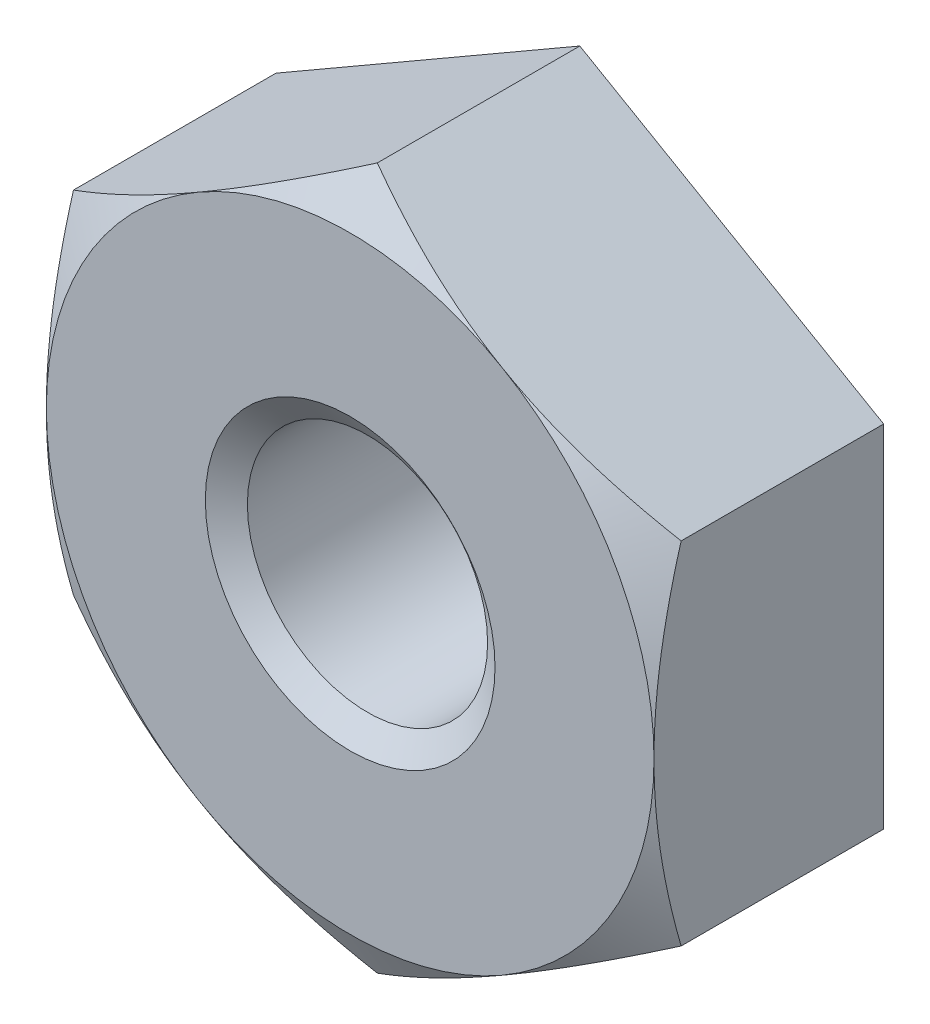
from build123d import *

# Parameters (mm, degrees)
BASENUT_START = -3.302
BASENUTSKE_R  = 1.7272
BASENUT_DEPTH = 3.302


with BuildPart() as part:
    # BaseNutSke → BaseNut (new body)
    with BuildSketch(Plane.XY.offset(BASENUT_START)):
        Polygon((4.3688, 2.522327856), (4.3688, -2.522327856), (0, -5.044655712), (-4.3688, -2.522327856), (-4.3688, 2.522327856), (0, 5.044655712), align=None)
        Circle(BASENUTSKE_R, mode=Mode.SUBTRACT)
    extrude(amount=BASENUT_DEPTH)

    # Sketch4 → Single-Chamfer (revolve, cut)
    with BuildSketch(Plane(origin=(0, 0, 0), x_dir=(0, 0, -1), z_dir=(1, 0, 0))):
        Polygon((0, 4.3688), (-12.7, 4.3688), (-12.7, 17.744655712), (0.390205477, 17.744655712), (0.390205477, 5.044655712), align=None)
    revolve(axis=Axis((0, 0, 0), (0, 0, -1)), mode=Mode.SUBTRACT)

    # EndChamferSketch → EndChamfer (revolve, cut)
    with BuildSketch(Plane(origin=(0, 0, 0), x_dir=(0, 0, -1), z_dir=(1, 0, 0)), mode=Mode.PRIVATE) as endchamfer_sk:
        Polygon((3.2766, 2.0828), (3.002706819, 1.69164), (3.3274, 1.69164), (3.3274, 2.0828), align=None)
        Polygon((-0.0508, 2.0828), (0, 2.0828), (0.273893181, 1.69164), (-0.0508, 1.69164), align=None)
    revolve(endchamfer_sk.sketch.rotate(Axis((0, 0, -25.037505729), (0, 0, -1)), 90), axis=Axis((0, 0, -25.037505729), (0, 0, -1)), mode=Mode.SUBTRACT)


solid = part.part
